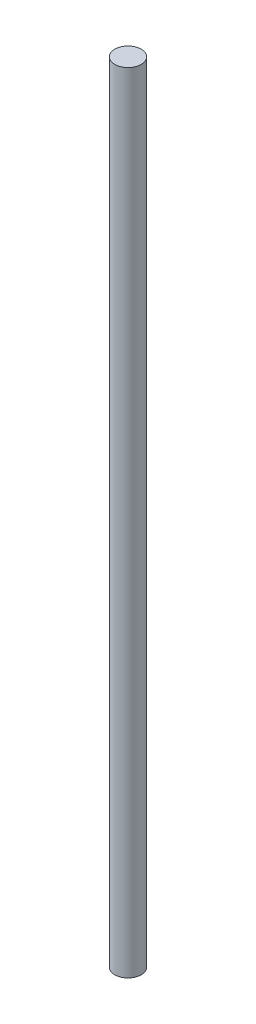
from build123d import *

# Parameters (mm, degrees)
SKETCH1_R      = 23.8125
EXTRUDE1_DEPTH = 1422.4


with BuildPart() as part:
    # Sketch1 → Extrude1 (new body)
    with BuildSketch(Plane(origin=(0, 0, 0), x_dir=(1, 0, 0), z_dir=(0, 1, 0))):
        with Locations(Location((0, 0, 0), (0, 0, 270))):
            Circle(SKETCH1_R)
    extrude(amount=EXTRUDE1_DEPTH)


solid = part.part
